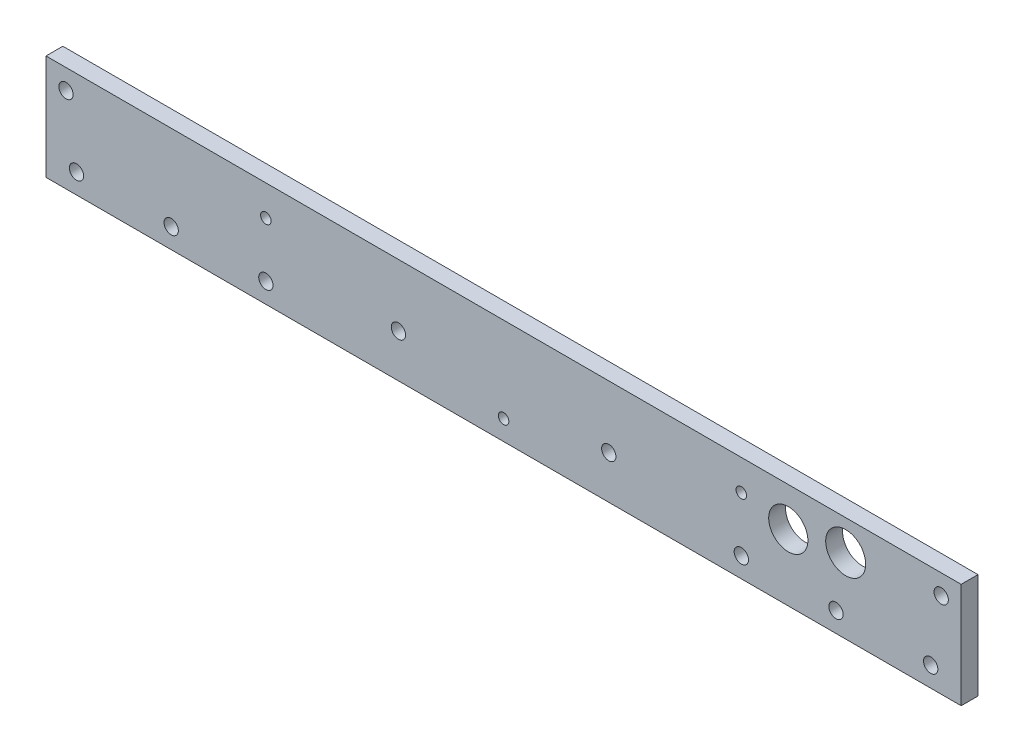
ISO-10303-21;
HEADER;
FILE_DESCRIPTION(('STEP AP214'),'2;1');
FILE_NAME('part.step','',(''),(''),'','','');
FILE_SCHEMA(('AUTOMOTIVE_DESIGN { 1 0 10303 214 1 1 1 1 }'));
ENDSEC;
DATA;
#1=APPLICATION_CONTEXT('core data for automotive mechanical design processes');
#2=APPLICATION_PROTOCOL_DEFINITION('international standard','automotive_design',2000,#1);
#3=PRODUCT_CONTEXT('',#1,'mechanical');
#4=PRODUCT('Part','Part','',(#3));
#5=PRODUCT_RELATED_PRODUCT_CATEGORY('part','',(#4));
#6=PRODUCT_DEFINITION_FORMATION('','',#4);
#7=PRODUCT_DEFINITION_CONTEXT('part definition',#1,'design');
#8=PRODUCT_DEFINITION('design','',#6,#7);
#9=PRODUCT_DEFINITION_SHAPE('','',#8);
#10=(LENGTH_UNIT() NAMED_UNIT(*) SI_UNIT(.MILLI.,.METRE.));
#11=(NAMED_UNIT(*) PLANE_ANGLE_UNIT() SI_UNIT($,.RADIAN.));
#12=(NAMED_UNIT(*) SI_UNIT($,.STERADIAN.) SOLID_ANGLE_UNIT());
#13=UNCERTAINTY_MEASURE_WITH_UNIT(LENGTH_MEASURE(1.E-05),#10,'distance_accuracy_value','');
#14=(GEOMETRIC_REPRESENTATION_CONTEXT(3) GLOBAL_UNCERTAINTY_ASSIGNED_CONTEXT((#13)) GLOBAL_UNIT_ASSIGNED_CONTEXT((#10,
#11,#12)) REPRESENTATION_CONTEXT('',''));
#15=CARTESIAN_POINT('',(0.,0.,0.));
#16=DIRECTION('',(0.,0.,1.));
#17=DIRECTION('',(1.,0.,0.));
#18=AXIS2_PLACEMENT_3D('',#15,#16,#17);
#19=CARTESIAN_POINT('',(0.,50.,8.));
#20=DIRECTION('',(0.,0.,-1.));
#21=DIRECTION('',(-1.,0.,0.));
#22=AXIS2_PLACEMENT_3D('',#19,#20,#21);
#23=PLANE('',#22);
#24=CARTESIAN_POINT('',(352.826244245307,31.6015957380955,8.));
#25=DIRECTION('',(0.,0.,1.));
#26=DIRECTION('',(1.,0.,0.));
#27=AXIS2_PLACEMENT_3D('',#24,#25,#26);
#28=CIRCLE('',#27,9.315);
#29=CARTESIAN_POINT('',(362.141244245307,31.6015957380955,8.));
#30=VERTEX_POINT('',#29);
#31=EDGE_CURVE('E195',#30,#30,#28,.T.);
#32=ORIENTED_EDGE('',*,*,#31,.F.);
#33=EDGE_LOOP('',(#32));
#34=FACE_BOUND('',#33,.T.);
#35=CARTESIAN_POINT('',(167.5,20.5,8.));
#36=DIRECTION('',(0.,0.,1.));
#37=DIRECTION('',(1.,0.,0.));
#38=AXIS2_PLACEMENT_3D('',#35,#36,#37);
#39=CIRCLE('',#38,3.39999999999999);
#40=CARTESIAN_POINT('',(170.9,20.5,8.));
#41=VERTEX_POINT('',#40);
#42=EDGE_CURVE('E186',#41,#41,#39,.T.);
#43=ORIENTED_EDGE('',*,*,#42,.F.);
#44=EDGE_LOOP('',(#43));
#45=FACE_BOUND('',#44,.T.);
#46=CARTESIAN_POINT('',(9.50000000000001,40.5,8.));
#47=DIRECTION('',(0.,0.,1.));
#48=DIRECTION('',(1.,0.,0.));
#49=AXIS2_PLACEMENT_3D('',#46,#47,#48);
#50=CIRCLE('',#49,3.39999999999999);
#51=CARTESIAN_POINT('',(12.9,40.5,8.));
#52=VERTEX_POINT('',#51);
#53=EDGE_CURVE('E168',#52,#52,#50,.T.);
#54=ORIENTED_EDGE('',*,*,#53,.F.);
#55=EDGE_LOOP('',(#54));
#56=FACE_BOUND('',#55,.T.);
#57=DIRECTION('',(0.,-1.,0.));
#58=VECTOR('',#57,1.);
#59=CARTESIAN_POINT('',(0.,0.,8.));
#60=LINE('',#59,#58);
#61=CARTESIAN_POINT('',(0.,50.,8.));
#62=VERTEX_POINT('',#61);
#63=CARTESIAN_POINT('',(0.,0.,8.));
#64=VERTEX_POINT('',#63);
#65=EDGE_CURVE('E86',#62,#64,#60,.T.);
#66=ORIENTED_EDGE('',*,*,#65,.T.);
#67=DIRECTION('',(1.,0.,0.));
#68=VECTOR('',#67,1.);
#69=CARTESIAN_POINT('',(0.,0.,8.));
#70=LINE('',#69,#68);
#71=CARTESIAN_POINT('',(435.,0.,8.));
#72=VERTEX_POINT('',#71);
#73=EDGE_CURVE('E81',#64,#72,#70,.T.);
#74=ORIENTED_EDGE('',*,*,#73,.T.);
#75=DIRECTION('',(0.,1.,0.));
#76=VECTOR('',#75,1.);
#77=CARTESIAN_POINT('',(435.,0.,8.));
#78=LINE('',#77,#76);
#79=CARTESIAN_POINT('',(435.,50.,8.));
#80=VERTEX_POINT('',#79);
#81=EDGE_CURVE('E84',#72,#80,#78,.T.);
#82=ORIENTED_EDGE('',*,*,#81,.T.);
#83=DIRECTION('',(-1.,0.,0.));
#84=VECTOR('',#83,1.);
#85=CARTESIAN_POINT('',(0.,50.,8.));
#86=LINE('',#85,#84);
#87=EDGE_CURVE('E51',#80,#62,#86,.T.);
#88=ORIENTED_EDGE('',*,*,#87,.T.);
#89=EDGE_LOOP('',(#66,#74,#82,#88));
#90=FACE_BOUND('',#89,.T.);
#91=CARTESIAN_POINT('',(330.5,35.5,8.));
#92=DIRECTION('',(0.,0.,1.));
#93=DIRECTION('',(1.,0.,0.));
#94=AXIS2_PLACEMENT_3D('',#91,#92,#93);
#95=CIRCLE('',#94,2.5);
#96=CARTESIAN_POINT('',(333.,35.5,8.));
#97=VERTEX_POINT('',#96);
#98=EDGE_CURVE('E114',#97,#97,#95,.T.);
#99=ORIENTED_EDGE('',*,*,#98,.F.);
#100=EDGE_LOOP('',(#99));
#101=FACE_BOUND('',#100,.T.);
#102=CARTESIAN_POINT('',(217.5,9.50000000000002,8.));
#103=DIRECTION('',(0.,0.,1.));
#104=DIRECTION('',(1.,0.,0.));
#105=AXIS2_PLACEMENT_3D('',#102,#103,#104);
#106=CIRCLE('',#105,2.49999999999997);
#107=CARTESIAN_POINT('',(220.,9.50000000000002,8.));
#108=VERTEX_POINT('',#107);
#109=EDGE_CURVE('E120',#108,#108,#106,.T.);
#110=ORIENTED_EDGE('',*,*,#109,.F.);
#111=EDGE_LOOP('',(#110));
#112=FACE_BOUND('',#111,.T.);
#113=CARTESIAN_POINT('',(104.5,35.5,8.));
#114=DIRECTION('',(0.,0.,1.));
#115=DIRECTION('',(1.,0.,0.));
#116=AXIS2_PLACEMENT_3D('',#113,#114,#115);
#117=CIRCLE('',#116,2.49999999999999);
#118=CARTESIAN_POINT('',(107.,35.5,8.));
#119=VERTEX_POINT('',#118);
#120=EDGE_CURVE('E126',#119,#119,#117,.T.);
#121=ORIENTED_EDGE('',*,*,#120,.F.);
#122=EDGE_LOOP('',(#121));
#123=FACE_BOUND('',#122,.T.);
#124=CARTESIAN_POINT('',(420.5,9.50000000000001,8.));
#125=DIRECTION('',(0.,0.,1.));
#126=DIRECTION('',(1.,0.,0.));
#127=AXIS2_PLACEMENT_3D('',#124,#125,#126);
#128=CIRCLE('',#127,3.40000000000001);
#129=CARTESIAN_POINT('',(423.9,9.50000000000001,8.));
#130=VERTEX_POINT('',#129);
#131=EDGE_CURVE('E132',#130,#130,#128,.T.);
#132=ORIENTED_EDGE('',*,*,#131,.F.);
#133=EDGE_LOOP('',(#132));
#134=FACE_BOUND('',#133,.T.);
#135=CARTESIAN_POINT('',(375.5,9.5,8.));
#136=DIRECTION('',(0.,0.,1.));
#137=DIRECTION('',(1.,0.,0.));
#138=AXIS2_PLACEMENT_3D('',#135,#136,#137);
#139=CIRCLE('',#138,3.40000000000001);
#140=CARTESIAN_POINT('',(378.9,9.5,8.));
#141=VERTEX_POINT('',#140);
#142=EDGE_CURVE('E138',#141,#141,#139,.T.);
#143=ORIENTED_EDGE('',*,*,#142,.F.);
#144=EDGE_LOOP('',(#143));
#145=FACE_BOUND('',#144,.T.);
#146=CARTESIAN_POINT('',(330.5,9.5,8.));
#147=DIRECTION('',(0.,0.,1.));
#148=DIRECTION('',(1.,0.,0.));
#149=AXIS2_PLACEMENT_3D('',#146,#147,#148);
#150=CIRCLE('',#149,3.40000000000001);
#151=CARTESIAN_POINT('',(333.9,9.5,8.));
#152=VERTEX_POINT('',#151);
#153=EDGE_CURVE('E144',#152,#152,#150,.T.);
#154=ORIENTED_EDGE('',*,*,#153,.F.);
#155=EDGE_LOOP('',(#154));
#156=FACE_BOUND('',#155,.T.);
#157=CARTESIAN_POINT('',(14.5,9.5,8.));
#158=DIRECTION('',(0.,0.,1.));
#159=DIRECTION('',(1.,0.,0.));
#160=AXIS2_PLACEMENT_3D('',#157,#158,#159);
#161=CIRCLE('',#160,3.39999999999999);
#162=CARTESIAN_POINT('',(17.9,9.5,8.));
#163=VERTEX_POINT('',#162);
#164=EDGE_CURVE('E150',#163,#163,#161,.T.);
#165=ORIENTED_EDGE('',*,*,#164,.F.);
#166=EDGE_LOOP('',(#165));
#167=FACE_BOUND('',#166,.T.);
#168=CARTESIAN_POINT('',(59.5,9.5,8.));
#169=DIRECTION('',(0.,0.,1.));
#170=DIRECTION('',(1.,0.,0.));
#171=AXIS2_PLACEMENT_3D('',#168,#169,#170);
#172=CIRCLE('',#171,3.39999999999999);
#173=CARTESIAN_POINT('',(62.9,9.5,8.));
#174=VERTEX_POINT('',#173);
#175=EDGE_CURVE('E156',#174,#174,#172,.T.);
#176=ORIENTED_EDGE('',*,*,#175,.F.);
#177=EDGE_LOOP('',(#176));
#178=FACE_BOUND('',#177,.T.);
#179=CARTESIAN_POINT('',(104.5,9.50000000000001,8.));
#180=DIRECTION('',(0.,0.,1.));
#181=DIRECTION('',(1.,0.,0.));
#182=AXIS2_PLACEMENT_3D('',#179,#180,#181);
#183=CIRCLE('',#182,3.39999999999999);
#184=CARTESIAN_POINT('',(107.9,9.50000000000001,8.));
#185=VERTEX_POINT('',#184);
#186=EDGE_CURVE('E162',#185,#185,#183,.T.);
#187=ORIENTED_EDGE('',*,*,#186,.F.);
#188=EDGE_LOOP('',(#187));
#189=FACE_BOUND('',#188,.T.);
#190=CARTESIAN_POINT('',(425.5,40.5,8.));
#191=DIRECTION('',(0.,0.,1.));
#192=DIRECTION('',(1.,0.,0.));
#193=AXIS2_PLACEMENT_3D('',#190,#191,#192);
#194=CIRCLE('',#193,3.39999999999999);
#195=CARTESIAN_POINT('',(428.9,40.5,8.));
#196=VERTEX_POINT('',#195);
#197=EDGE_CURVE('E174',#196,#196,#194,.T.);
#198=ORIENTED_EDGE('',*,*,#197,.F.);
#199=EDGE_LOOP('',(#198));
#200=FACE_BOUND('',#199,.T.);
#201=CARTESIAN_POINT('',(267.5,20.5,8.));
#202=DIRECTION('',(0.,0.,1.));
#203=DIRECTION('',(1.,0.,0.));
#204=AXIS2_PLACEMENT_3D('',#201,#202,#203);
#205=CIRCLE('',#204,3.40000000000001);
#206=CARTESIAN_POINT('',(270.9,20.5,8.));
#207=VERTEX_POINT('',#206);
#208=EDGE_CURVE('E180',#207,#207,#205,.T.);
#209=ORIENTED_EDGE('',*,*,#208,.F.);
#210=EDGE_LOOP('',(#209));
#211=FACE_BOUND('',#210,.T.);
#212=CARTESIAN_POINT('',(380.110073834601,35.5870976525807,8.));
#213=DIRECTION('',(0.,0.,1.));
#214=DIRECTION('',(1.,0.,0.));
#215=AXIS2_PLACEMENT_3D('',#212,#213,#214);
#216=CIRCLE('',#215,9.50000000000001);
#217=CARTESIAN_POINT('',(389.610073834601,35.5870976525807,8.));
#218=VERTEX_POINT('',#217);
#219=EDGE_CURVE('E192',#218,#218,#216,.T.);
#220=ORIENTED_EDGE('',*,*,#219,.F.);
#221=EDGE_LOOP('',(#220));
#222=FACE_BOUND('',#221,.T.);
#223=ADVANCED_FACE('F34',(#34,#45,#56,#90,#101,#112,#123,#134,#145,#156,#167,#178,#189,#200,
#211,#222),#23,.F.);
#224=CARTESIAN_POINT('',(0.,0.,8.));
#225=DIRECTION('',(1.,0.,0.));
#226=DIRECTION('',(0.,0.,-1.));
#227=AXIS2_PLACEMENT_3D('',#224,#225,#226);
#228=PLANE('',#227);
#229=DIRECTION('',(0.,-1.,0.));
#230=VECTOR('',#229,1.);
#231=CARTESIAN_POINT('',(0.,0.,0.));
#232=LINE('',#231,#230);
#233=CARTESIAN_POINT('',(0.,50.,0.));
#234=VERTEX_POINT('',#233);
#235=CARTESIAN_POINT('',(0.,0.,0.));
#236=VERTEX_POINT('',#235);
#237=EDGE_CURVE('E98',#234,#236,#232,.T.);
#238=ORIENTED_EDGE('',*,*,#237,.T.);
#239=DIRECTION('',(0.,0.,-1.));
#240=VECTOR('',#239,1.);
#241=CARTESIAN_POINT('',(0.,0.,8.));
#242=LINE('',#241,#240);
#243=EDGE_CURVE('E11',#64,#236,#242,.T.);
#244=ORIENTED_EDGE('',*,*,#243,.F.);
#245=ORIENTED_EDGE('',*,*,#65,.F.);
#246=DIRECTION('',(0.,0.,-1.));
#247=VECTOR('',#246,1.);
#248=CARTESIAN_POINT('',(0.,50.,8.));
#249=LINE('',#248,#247);
#250=EDGE_CURVE('E94',#62,#234,#249,.T.);
#251=ORIENTED_EDGE('',*,*,#250,.T.);
#252=EDGE_LOOP('',(#238,#244,#245,#251));
#253=FACE_BOUND('',#252,.T.);
#254=ADVANCED_FACE('F36',(#253),#228,.F.);
#255=CARTESIAN_POINT('',(0.,0.,8.));
#256=DIRECTION('',(0.,1.,0.));
#257=DIRECTION('',(0.,0.,1.));
#258=AXIS2_PLACEMENT_3D('',#255,#256,#257);
#259=PLANE('',#258);
#260=DIRECTION('',(1.,0.,0.));
#261=VECTOR('',#260,1.);
#262=CARTESIAN_POINT('',(0.,0.,0.));
#263=LINE('',#262,#261);
#264=CARTESIAN_POINT('',(435.,0.,0.));
#265=VERTEX_POINT('',#264);
#266=EDGE_CURVE('E90',#236,#265,#263,.T.);
#267=ORIENTED_EDGE('',*,*,#266,.T.);
#268=DIRECTION('',(0.,0.,-1.));
#269=VECTOR('',#268,1.);
#270=CARTESIAN_POINT('',(435.,0.,8.));
#271=LINE('',#270,#269);
#272=EDGE_CURVE('E43',#72,#265,#271,.T.);
#273=ORIENTED_EDGE('',*,*,#272,.F.);
#274=ORIENTED_EDGE('',*,*,#73,.F.);
#275=ORIENTED_EDGE('',*,*,#243,.T.);
#276=EDGE_LOOP('',(#267,#273,#274,#275));
#277=FACE_BOUND('',#276,.T.);
#278=ADVANCED_FACE('F89',(#277),#259,.F.);
#279=CARTESIAN_POINT('',(435.,0.,8.));
#280=DIRECTION('',(-1.,0.,0.));
#281=DIRECTION('',(0.,0.,1.));
#282=AXIS2_PLACEMENT_3D('',#279,#280,#281);
#283=PLANE('',#282);
#284=DIRECTION('',(0.,1.,0.));
#285=VECTOR('',#284,1.);
#286=CARTESIAN_POINT('',(435.,0.,0.));
#287=LINE('',#286,#285);
#288=CARTESIAN_POINT('',(435.,50.,0.));
#289=VERTEX_POINT('',#288);
#290=EDGE_CURVE('E68',#265,#289,#287,.T.);
#291=ORIENTED_EDGE('',*,*,#290,.T.);
#292=DIRECTION('',(0.,0.,-1.));
#293=VECTOR('',#292,1.);
#294=CARTESIAN_POINT('',(435.,50.,8.));
#295=LINE('',#294,#293);
#296=EDGE_CURVE('E91',#80,#289,#295,.T.);
#297=ORIENTED_EDGE('',*,*,#296,.F.);
#298=ORIENTED_EDGE('',*,*,#81,.F.);
#299=ORIENTED_EDGE('',*,*,#272,.T.);
#300=EDGE_LOOP('',(#291,#297,#298,#299));
#301=FACE_BOUND('',#300,.T.);
#302=ADVANCED_FACE('F92',(#301),#283,.F.);
#303=CARTESIAN_POINT('',(0.,50.,8.));
#304=DIRECTION('',(0.,-1.,0.));
#305=DIRECTION('',(0.,0.,-1.));
#306=AXIS2_PLACEMENT_3D('',#303,#304,#305);
#307=PLANE('',#306);
#308=DIRECTION('',(-1.,0.,0.));
#309=VECTOR('',#308,1.);
#310=CARTESIAN_POINT('',(0.,50.,0.));
#311=LINE('',#310,#309);
#312=EDGE_CURVE('E74',#289,#234,#311,.T.);
#313=ORIENTED_EDGE('',*,*,#312,.T.);
#314=ORIENTED_EDGE('',*,*,#250,.F.);
#315=ORIENTED_EDGE('',*,*,#87,.F.);
#316=ORIENTED_EDGE('',*,*,#296,.T.);
#317=EDGE_LOOP('',(#313,#314,#315,#316));
#318=FACE_BOUND('',#317,.T.);
#319=ADVANCED_FACE('F106',(#318),#307,.F.);
#320=CARTESIAN_POINT('',(0.,50.,0.));
#321=DIRECTION('',(0.,0.,-1.));
#322=DIRECTION('',(-1.,0.,0.));
#323=AXIS2_PLACEMENT_3D('',#320,#321,#322);
#324=PLANE('',#323);
#325=CARTESIAN_POINT('',(352.826244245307,31.6015957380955,0.));
#326=DIRECTION('',(0.,0.,-1.));
#327=DIRECTION('',(-1.,0.,0.));
#328=AXIS2_PLACEMENT_3D('',#325,#326,#327);
#329=CIRCLE('',#328,9.315);
#330=CARTESIAN_POINT('',(343.511244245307,31.6015957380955,0.));
#331=VERTEX_POINT('',#330);
#332=EDGE_CURVE('E196',#331,#331,#329,.F.);
#333=ORIENTED_EDGE('',*,*,#332,.T.);
#334=EDGE_LOOP('',(#333));
#335=FACE_BOUND('',#334,.T.);
#336=CARTESIAN_POINT('',(380.110073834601,35.5870976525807,0.));
#337=DIRECTION('',(0.,0.,-1.));
#338=DIRECTION('',(-1.,0.,0.));
#339=AXIS2_PLACEMENT_3D('',#336,#337,#338);
#340=CIRCLE('',#339,9.50000000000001);
#341=CARTESIAN_POINT('',(370.610073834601,35.5870976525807,0.));
#342=VERTEX_POINT('',#341);
#343=EDGE_CURVE('E189',#342,#342,#340,.T.);
#344=ORIENTED_EDGE('',*,*,#343,.F.);
#345=EDGE_LOOP('',(#344));
#346=FACE_BOUND('',#345,.T.);
#347=CARTESIAN_POINT('',(167.5,20.5,0.));
#348=DIRECTION('',(0.,0.,-1.));
#349=DIRECTION('',(-1.,0.,0.));
#350=AXIS2_PLACEMENT_3D('',#347,#348,#349);
#351=CIRCLE('',#350,3.39999999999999);
#352=CARTESIAN_POINT('',(164.1,20.5,0.));
#353=VERTEX_POINT('',#352);
#354=EDGE_CURVE('E183',#353,#353,#351,.T.);
#355=ORIENTED_EDGE('',*,*,#354,.F.);
#356=EDGE_LOOP('',(#355));
#357=FACE_BOUND('',#356,.T.);
#358=CARTESIAN_POINT('',(267.5,20.5,0.));
#359=DIRECTION('',(0.,0.,-1.));
#360=DIRECTION('',(-1.,0.,0.));
#361=AXIS2_PLACEMENT_3D('',#358,#359,#360);
#362=CIRCLE('',#361,3.40000000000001);
#363=CARTESIAN_POINT('',(264.1,20.5,0.));
#364=VERTEX_POINT('',#363);
#365=EDGE_CURVE('E177',#364,#364,#362,.T.);
#366=ORIENTED_EDGE('',*,*,#365,.F.);
#367=EDGE_LOOP('',(#366));
#368=FACE_BOUND('',#367,.T.);
#369=CARTESIAN_POINT('',(425.5,40.5,0.));
#370=DIRECTION('',(0.,0.,-1.));
#371=DIRECTION('',(-1.,0.,0.));
#372=AXIS2_PLACEMENT_3D('',#369,#370,#371);
#373=CIRCLE('',#372,3.39999999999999);
#374=CARTESIAN_POINT('',(422.1,40.5,0.));
#375=VERTEX_POINT('',#374);
#376=EDGE_CURVE('E171',#375,#375,#373,.T.);
#377=ORIENTED_EDGE('',*,*,#376,.F.);
#378=EDGE_LOOP('',(#377));
#379=FACE_BOUND('',#378,.T.);
#380=CARTESIAN_POINT('',(9.50000000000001,40.5,0.));
#381=DIRECTION('',(0.,0.,-1.));
#382=DIRECTION('',(-1.,0.,0.));
#383=AXIS2_PLACEMENT_3D('',#380,#381,#382);
#384=CIRCLE('',#383,3.39999999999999);
#385=CARTESIAN_POINT('',(6.10000000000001,40.5,0.));
#386=VERTEX_POINT('',#385);
#387=EDGE_CURVE('E165',#386,#386,#384,.T.);
#388=ORIENTED_EDGE('',*,*,#387,.F.);
#389=EDGE_LOOP('',(#388));
#390=FACE_BOUND('',#389,.T.);
#391=CARTESIAN_POINT('',(104.5,9.50000000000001,0.));
#392=DIRECTION('',(0.,0.,-1.));
#393=DIRECTION('',(-1.,0.,0.));
#394=AXIS2_PLACEMENT_3D('',#391,#392,#393);
#395=CIRCLE('',#394,3.39999999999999);
#396=CARTESIAN_POINT('',(101.1,9.50000000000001,0.));
#397=VERTEX_POINT('',#396);
#398=EDGE_CURVE('E159',#397,#397,#395,.T.);
#399=ORIENTED_EDGE('',*,*,#398,.F.);
#400=EDGE_LOOP('',(#399));
#401=FACE_BOUND('',#400,.T.);
#402=CARTESIAN_POINT('',(59.5,9.5,0.));
#403=DIRECTION('',(0.,0.,-1.));
#404=DIRECTION('',(-1.,0.,0.));
#405=AXIS2_PLACEMENT_3D('',#402,#403,#404);
#406=CIRCLE('',#405,3.39999999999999);
#407=CARTESIAN_POINT('',(56.1,9.5,0.));
#408=VERTEX_POINT('',#407);
#409=EDGE_CURVE('E153',#408,#408,#406,.T.);
#410=ORIENTED_EDGE('',*,*,#409,.F.);
#411=EDGE_LOOP('',(#410));
#412=FACE_BOUND('',#411,.T.);
#413=CARTESIAN_POINT('',(14.5,9.5,0.));
#414=DIRECTION('',(0.,0.,-1.));
#415=DIRECTION('',(-1.,0.,0.));
#416=AXIS2_PLACEMENT_3D('',#413,#414,#415);
#417=CIRCLE('',#416,3.39999999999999);
#418=CARTESIAN_POINT('',(11.1,9.5,0.));
#419=VERTEX_POINT('',#418);
#420=EDGE_CURVE('E147',#419,#419,#417,.T.);
#421=ORIENTED_EDGE('',*,*,#420,.F.);
#422=EDGE_LOOP('',(#421));
#423=FACE_BOUND('',#422,.T.);
#424=CARTESIAN_POINT('',(330.5,9.5,0.));
#425=DIRECTION('',(0.,0.,-1.));
#426=DIRECTION('',(-1.,0.,0.));
#427=AXIS2_PLACEMENT_3D('',#424,#425,#426);
#428=CIRCLE('',#427,3.40000000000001);
#429=CARTESIAN_POINT('',(327.1,9.5,0.));
#430=VERTEX_POINT('',#429);
#431=EDGE_CURVE('E141',#430,#430,#428,.T.);
#432=ORIENTED_EDGE('',*,*,#431,.F.);
#433=EDGE_LOOP('',(#432));
#434=FACE_BOUND('',#433,.T.);
#435=CARTESIAN_POINT('',(375.5,9.5,0.));
#436=DIRECTION('',(0.,0.,-1.));
#437=DIRECTION('',(-1.,0.,0.));
#438=AXIS2_PLACEMENT_3D('',#435,#436,#437);
#439=CIRCLE('',#438,3.40000000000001);
#440=CARTESIAN_POINT('',(372.1,9.5,0.));
#441=VERTEX_POINT('',#440);
#442=EDGE_CURVE('E135',#441,#441,#439,.T.);
#443=ORIENTED_EDGE('',*,*,#442,.F.);
#444=EDGE_LOOP('',(#443));
#445=FACE_BOUND('',#444,.T.);
#446=CARTESIAN_POINT('',(420.5,9.50000000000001,0.));
#447=DIRECTION('',(0.,0.,-1.));
#448=DIRECTION('',(-1.,0.,0.));
#449=AXIS2_PLACEMENT_3D('',#446,#447,#448);
#450=CIRCLE('',#449,3.40000000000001);
#451=CARTESIAN_POINT('',(417.1,9.50000000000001,0.));
#452=VERTEX_POINT('',#451);
#453=EDGE_CURVE('E129',#452,#452,#450,.T.);
#454=ORIENTED_EDGE('',*,*,#453,.F.);
#455=EDGE_LOOP('',(#454));
#456=FACE_BOUND('',#455,.T.);
#457=CARTESIAN_POINT('',(104.5,35.5,0.));
#458=DIRECTION('',(0.,0.,-1.));
#459=DIRECTION('',(-1.,0.,0.));
#460=AXIS2_PLACEMENT_3D('',#457,#458,#459);
#461=CIRCLE('',#460,2.5);
#462=CARTESIAN_POINT('',(102.,35.5,0.));
#463=VERTEX_POINT('',#462);
#464=EDGE_CURVE('E123',#463,#463,#461,.T.);
#465=ORIENTED_EDGE('',*,*,#464,.F.);
#466=EDGE_LOOP('',(#465));
#467=FACE_BOUND('',#466,.T.);
#468=CARTESIAN_POINT('',(217.5,9.50000000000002,0.));
#469=DIRECTION('',(0.,0.,-1.));
#470=DIRECTION('',(-1.,0.,0.));
#471=AXIS2_PLACEMENT_3D('',#468,#469,#470);
#472=CIRCLE('',#471,2.49999999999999);
#473=CARTESIAN_POINT('',(215.,9.50000000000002,0.));
#474=VERTEX_POINT('',#473);
#475=EDGE_CURVE('E117',#474,#474,#472,.T.);
#476=ORIENTED_EDGE('',*,*,#475,.F.);
#477=EDGE_LOOP('',(#476));
#478=FACE_BOUND('',#477,.T.);
#479=CARTESIAN_POINT('',(330.5,35.5,0.));
#480=DIRECTION('',(0.,0.,-1.));
#481=DIRECTION('',(-1.,0.,0.));
#482=AXIS2_PLACEMENT_3D('',#479,#480,#481);
#483=CIRCLE('',#482,2.5);
#484=CARTESIAN_POINT('',(328.,35.5,0.));
#485=VERTEX_POINT('',#484);
#486=EDGE_CURVE('E101',#485,#485,#483,.T.);
#487=ORIENTED_EDGE('',*,*,#486,.F.);
#488=EDGE_LOOP('',(#487));
#489=FACE_BOUND('',#488,.T.);
#490=ORIENTED_EDGE('',*,*,#237,.F.);
#491=ORIENTED_EDGE('',*,*,#312,.F.);
#492=ORIENTED_EDGE('',*,*,#290,.F.);
#493=ORIENTED_EDGE('',*,*,#266,.F.);
#494=EDGE_LOOP('',(#490,#491,#492,#493));
#495=FACE_BOUND('',#494,.T.);
#496=ADVANCED_FACE('F109',(#335,#346,#357,#368,#379,#390,#401,#412,#423,#434,#445,#456,#467,
#478,#489,#495),#324,.T.);
#497=CARTESIAN_POINT('',(330.5,35.5,8.));
#498=DIRECTION('',(0.,0.,1.));
#499=DIRECTION('',(1.,0.,0.));
#500=AXIS2_PLACEMENT_3D('',#497,#498,#499);
#501=CYLINDRICAL_SURFACE('',#500,2.5);
#502=ORIENTED_EDGE('',*,*,#98,.T.);
#503=EDGE_LOOP('',(#502));
#504=FACE_BOUND('',#503,.T.);
#505=ORIENTED_EDGE('',*,*,#486,.T.);
#506=EDGE_LOOP('',(#505));
#507=FACE_BOUND('',#506,.T.);
#508=ADVANCED_FACE('F221',(#504,#507),#501,.F.);
#509=CARTESIAN_POINT('',(217.5,9.50000000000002,8.));
#510=DIRECTION('',(0.,0.,1.));
#511=DIRECTION('',(1.,0.,0.));
#512=AXIS2_PLACEMENT_3D('',#509,#510,#511);
#513=CYLINDRICAL_SURFACE('',#512,2.49999999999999);
#514=ORIENTED_EDGE('',*,*,#109,.T.);
#515=EDGE_LOOP('',(#514));
#516=FACE_BOUND('',#515,.T.);
#517=ORIENTED_EDGE('',*,*,#475,.T.);
#518=EDGE_LOOP('',(#517));
#519=FACE_BOUND('',#518,.T.);
#520=ADVANCED_FACE('F243',(#516,#519),#513,.F.);
#521=CARTESIAN_POINT('',(104.5,35.5,8.));
#522=DIRECTION('',(0.,0.,1.));
#523=DIRECTION('',(1.,0.,0.));
#524=AXIS2_PLACEMENT_3D('',#521,#522,#523);
#525=CYLINDRICAL_SURFACE('',#524,2.5);
#526=ORIENTED_EDGE('',*,*,#120,.T.);
#527=EDGE_LOOP('',(#526));
#528=FACE_BOUND('',#527,.T.);
#529=ORIENTED_EDGE('',*,*,#464,.T.);
#530=EDGE_LOOP('',(#529));
#531=FACE_BOUND('',#530,.T.);
#532=ADVANCED_FACE('F250',(#528,#531),#525,.F.);
#533=CARTESIAN_POINT('',(420.5,9.50000000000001,8.));
#534=DIRECTION('',(0.,0.,1.));
#535=DIRECTION('',(1.,0.,0.));
#536=AXIS2_PLACEMENT_3D('',#533,#534,#535);
#537=CYLINDRICAL_SURFACE('',#536,3.40000000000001);
#538=ORIENTED_EDGE('',*,*,#131,.T.);
#539=EDGE_LOOP('',(#538));
#540=FACE_BOUND('',#539,.T.);
#541=ORIENTED_EDGE('',*,*,#453,.T.);
#542=EDGE_LOOP('',(#541));
#543=FACE_BOUND('',#542,.T.);
#544=ADVANCED_FACE('F300',(#540,#543),#537,.F.);
#545=CARTESIAN_POINT('',(375.5,9.5,8.));
#546=DIRECTION('',(0.,0.,1.));
#547=DIRECTION('',(1.,0.,0.));
#548=AXIS2_PLACEMENT_3D('',#545,#546,#547);
#549=CYLINDRICAL_SURFACE('',#548,3.40000000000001);
#550=ORIENTED_EDGE('',*,*,#142,.T.);
#551=EDGE_LOOP('',(#550));
#552=FACE_BOUND('',#551,.T.);
#553=ORIENTED_EDGE('',*,*,#442,.T.);
#554=EDGE_LOOP('',(#553));
#555=FACE_BOUND('',#554,.T.);
#556=ADVANCED_FACE('F309',(#552,#555),#549,.F.);
#557=CARTESIAN_POINT('',(330.5,9.5,8.));
#558=DIRECTION('',(0.,0.,1.));
#559=DIRECTION('',(1.,0.,0.));
#560=AXIS2_PLACEMENT_3D('',#557,#558,#559);
#561=CYLINDRICAL_SURFACE('',#560,3.40000000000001);
#562=ORIENTED_EDGE('',*,*,#153,.T.);
#563=EDGE_LOOP('',(#562));
#564=FACE_BOUND('',#563,.T.);
#565=ORIENTED_EDGE('',*,*,#431,.T.);
#566=EDGE_LOOP('',(#565));
#567=FACE_BOUND('',#566,.T.);
#568=ADVANCED_FACE('F319',(#564,#567),#561,.F.);
#569=CARTESIAN_POINT('',(14.5,9.5,8.));
#570=DIRECTION('',(0.,0.,1.));
#571=DIRECTION('',(1.,0.,0.));
#572=AXIS2_PLACEMENT_3D('',#569,#570,#571);
#573=CYLINDRICAL_SURFACE('',#572,3.39999999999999);
#574=ORIENTED_EDGE('',*,*,#164,.T.);
#575=EDGE_LOOP('',(#574));
#576=FACE_BOUND('',#575,.T.);
#577=ORIENTED_EDGE('',*,*,#420,.T.);
#578=EDGE_LOOP('',(#577));
#579=FACE_BOUND('',#578,.T.);
#580=ADVANCED_FACE('F329',(#576,#579),#573,.F.);
#581=CARTESIAN_POINT('',(59.5,9.5,8.));
#582=DIRECTION('',(0.,0.,1.));
#583=DIRECTION('',(1.,0.,0.));
#584=AXIS2_PLACEMENT_3D('',#581,#582,#583);
#585=CYLINDRICAL_SURFACE('',#584,3.39999999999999);
#586=ORIENTED_EDGE('',*,*,#175,.T.);
#587=EDGE_LOOP('',(#586));
#588=FACE_BOUND('',#587,.T.);
#589=ORIENTED_EDGE('',*,*,#409,.T.);
#590=EDGE_LOOP('',(#589));
#591=FACE_BOUND('',#590,.T.);
#592=ADVANCED_FACE('F339',(#588,#591),#585,.F.);
#593=CARTESIAN_POINT('',(104.5,9.50000000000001,8.));
#594=DIRECTION('',(0.,0.,1.));
#595=DIRECTION('',(1.,0.,0.));
#596=AXIS2_PLACEMENT_3D('',#593,#594,#595);
#597=CYLINDRICAL_SURFACE('',#596,3.39999999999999);
#598=ORIENTED_EDGE('',*,*,#186,.T.);
#599=EDGE_LOOP('',(#598));
#600=FACE_BOUND('',#599,.T.);
#601=ORIENTED_EDGE('',*,*,#398,.T.);
#602=EDGE_LOOP('',(#601));
#603=FACE_BOUND('',#602,.T.);
#604=ADVANCED_FACE('F215',(#600,#603),#597,.F.);
#605=CARTESIAN_POINT('',(9.50000000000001,40.5,8.));
#606=DIRECTION('',(0.,0.,1.));
#607=DIRECTION('',(1.,0.,0.));
#608=AXIS2_PLACEMENT_3D('',#605,#606,#607);
#609=CYLINDRICAL_SURFACE('',#608,3.39999999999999);
#610=ORIENTED_EDGE('',*,*,#53,.T.);
#611=EDGE_LOOP('',(#610));
#612=FACE_BOUND('',#611,.T.);
#613=ORIENTED_EDGE('',*,*,#387,.T.);
#614=EDGE_LOOP('',(#613));
#615=FACE_BOUND('',#614,.T.);
#616=ADVANCED_FACE('F211',(#612,#615),#609,.F.);
#617=CARTESIAN_POINT('',(425.5,40.5,8.));
#618=DIRECTION('',(0.,0.,1.));
#619=DIRECTION('',(1.,0.,0.));
#620=AXIS2_PLACEMENT_3D('',#617,#618,#619);
#621=CYLINDRICAL_SURFACE('',#620,3.39999999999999);
#622=ORIENTED_EDGE('',*,*,#197,.T.);
#623=EDGE_LOOP('',(#622));
#624=FACE_BOUND('',#623,.T.);
#625=ORIENTED_EDGE('',*,*,#376,.T.);
#626=EDGE_LOOP('',(#625));
#627=FACE_BOUND('',#626,.T.);
#628=ADVANCED_FACE('F214',(#624,#627),#621,.F.);
#629=CARTESIAN_POINT('',(267.5,20.5,8.));
#630=DIRECTION('',(0.,0.,1.));
#631=DIRECTION('',(1.,0.,0.));
#632=AXIS2_PLACEMENT_3D('',#629,#630,#631);
#633=CYLINDRICAL_SURFACE('',#632,3.40000000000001);
#634=ORIENTED_EDGE('',*,*,#208,.T.);
#635=EDGE_LOOP('',(#634));
#636=FACE_BOUND('',#635,.T.);
#637=ORIENTED_EDGE('',*,*,#365,.T.);
#638=EDGE_LOOP('',(#637));
#639=FACE_BOUND('',#638,.T.);
#640=ADVANCED_FACE('F374',(#636,#639),#633,.F.);
#641=CARTESIAN_POINT('',(167.5,20.5,8.));
#642=DIRECTION('',(0.,0.,1.));
#643=DIRECTION('',(1.,0.,0.));
#644=AXIS2_PLACEMENT_3D('',#641,#642,#643);
#645=CYLINDRICAL_SURFACE('',#644,3.39999999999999);
#646=ORIENTED_EDGE('',*,*,#42,.T.);
#647=EDGE_LOOP('',(#646));
#648=FACE_BOUND('',#647,.T.);
#649=ORIENTED_EDGE('',*,*,#354,.T.);
#650=EDGE_LOOP('',(#649));
#651=FACE_BOUND('',#650,.T.);
#652=ADVANCED_FACE('F385',(#648,#651),#645,.F.);
#653=CARTESIAN_POINT('',(380.110073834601,35.5870976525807,8.));
#654=DIRECTION('',(0.,0.,1.));
#655=DIRECTION('',(1.,0.,0.));
#656=AXIS2_PLACEMENT_3D('',#653,#654,#655);
#657=CYLINDRICAL_SURFACE('',#656,9.50000000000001);
#658=ORIENTED_EDGE('',*,*,#219,.T.);
#659=EDGE_LOOP('',(#658));
#660=FACE_BOUND('',#659,.T.);
#661=ORIENTED_EDGE('',*,*,#343,.T.);
#662=EDGE_LOOP('',(#661));
#663=FACE_BOUND('',#662,.T.);
#664=ADVANCED_FACE('F395',(#660,#663),#657,.F.);
#665=CARTESIAN_POINT('',(352.826244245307,31.6015957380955,-0.000999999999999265));
#666=DIRECTION('',(0.,0.,1.));
#667=DIRECTION('',(1.,0.,0.));
#668=AXIS2_PLACEMENT_3D('',#665,#666,#667);
#669=CYLINDRICAL_SURFACE('',#668,9.315);
#670=ORIENTED_EDGE('',*,*,#332,.F.);
#671=EDGE_LOOP('',(#670));
#672=FACE_BOUND('',#671,.T.);
#673=ORIENTED_EDGE('',*,*,#31,.T.);
#674=EDGE_LOOP('',(#673));
#675=FACE_BOUND('',#674,.T.);
#676=ADVANCED_FACE('F202',(#672,#675),#669,.F.);
#677=CLOSED_SHELL('',(#223,#254,#278,#302,#319,#496,#508,#520,#532,#544,#556,#568,#580,#592,
#604,#616,#628,#640,#652,#664,#676));
#678=MANIFOLD_SOLID_BREP('B2',#677);
#679=ADVANCED_BREP_SHAPE_REPRESENTATION('',(#18,#678),#14);
#680=SHAPE_DEFINITION_REPRESENTATION(#9,#679);
ENDSEC;
END-ISO-10303-21;
